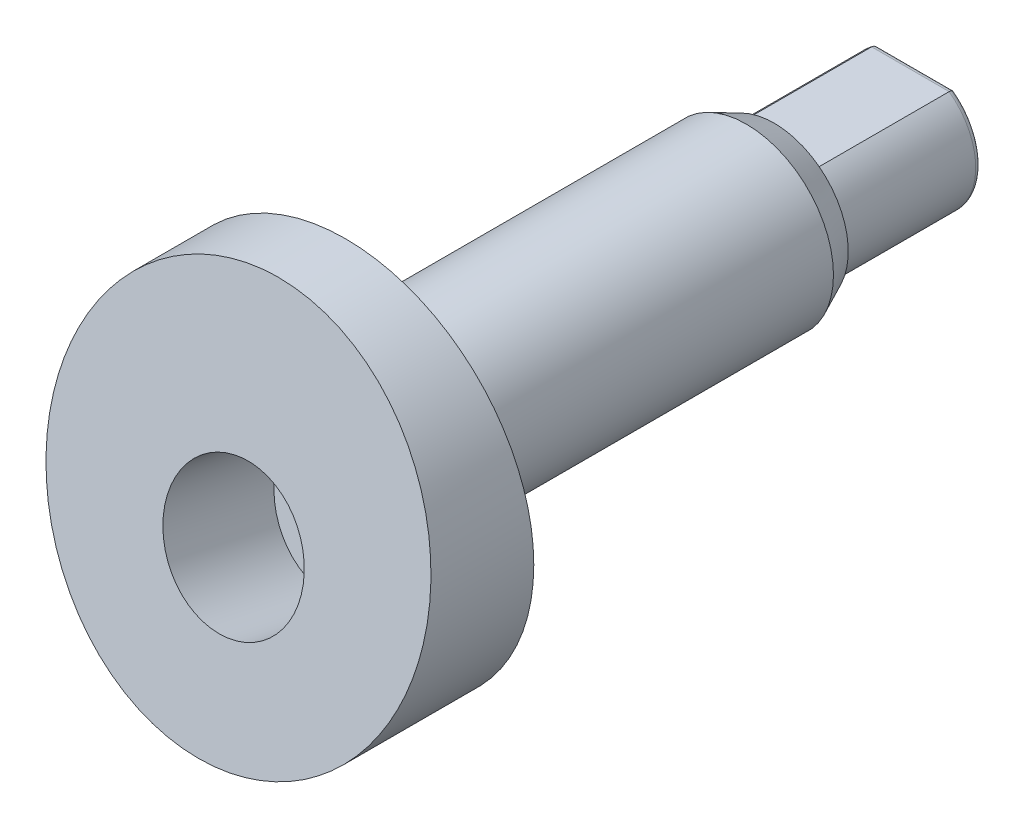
from build123d import *

# Parameters (mm, degrees)
SKETCH1_R             = 8.636
SWASH_BASE_DEPTH      = 6.7437
SWASH_ANGLE_CUT_DEPTH = 12.829383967
SKETCH4_R             = 3.99034
MOTOR_SHAFT_DEPTH     = 26.162
SKETCH5_OUTSIDE_W     = 27.468
SKETCH5_OUTSIDE_H     = 27.468
D_CUT_DEPTH           = 6.5024
FILLET4_R             = 0.254
CHAMFER1_SIZE         = 1.27
CHAMFER1_SIZE2        = 0.592210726
SKETCH9_R             = 3.175
CUT_EXTRUDE2_DEPTH    = 5.207


with BuildPart() as part:
    # Sketch1 → swash_base (new body)
    with BuildSketch(Plane.XY):
        Circle(SKETCH1_R)
    extrude(amount=SWASH_BASE_DEPTH)

    # Sketch2 → swash_angle_cut (cut, symmetric)
    with BuildSketch(Plane(origin=(0, 0, 0), x_dir=(0, 0, -1), z_dir=(1, 0, 0))):
        Polygon((-6.7437, -8.636), (-6.7437, 8.636), (-3.072423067, 8.636), align=None)
    extrude(amount=SWASH_ANGLE_CUT_DEPTH, both=True, mode=Mode.SUBTRACT)

    # Sketch4 → motor_shaft (add)
    with BuildSketch(Plane(origin=(0, 0, 0), x_dir=(-1, 0, 0), z_dir=(0, 0, -1))):
        with Locations(Location((0, 0, 0), (0, 0, 180))):
            Circle(SKETCH4_R)
    extrude(amount=MOTOR_SHAFT_DEPTH)

    # Sketch5 outside → D_cut (cut)
    with BuildSketch(Plane(origin=(0, 0, -26.162), x_dir=(-1, 0, 0), z_dir=(0, 0, -1))):
        Rectangle(SKETCH5_OUTSIDE_W, SKETCH5_OUTSIDE_H)
        with BuildLine():
            Line((0, 2.413), (1.777818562, 2.413))
            ThreePointArc((1.777818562, 2.413), (0, -2.9972), (-1.777818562, 2.413))
            Line((-1.777818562, 2.413), (0, 2.413))
        make_face(mode=Mode.SUBTRACT)
    extrude(amount=-D_CUT_DEPTH, mode=Mode.SUBTRACT)

    # Fillet4
    fillet4_edges = [part.edges().sort_by_distance(p)[0] for p in [
        (0, 2.413, -26.162),
        (0, -2.9972, -26.162),
    ]]
    fillet(fillet4_edges, radius=FILLET4_R)

    # Chamfer1
    chamfer1_edges = [part.edges().sort_by_distance(p)[0] for p in [
        (-3.99034, 0, -19.6596),
    ]]
    chamfer1_side = [part.faces().sort_by_distance(p)[0] for p in [
        (-3.99034, 0, -9.8298),
    ]]
    chamfer(chamfer1_edges, length=CHAMFER1_SIZE, length2=CHAMFER1_SIZE2, reference=chamfer1_side[0])

    # Sketch9 → Cut-Extrude2 (cut)
    with BuildSketch(Plane(origin=(0, 0.998144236, 4.695899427), x_dir=(1, 0, 0), z_dir=(0, 0.2079116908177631, 0.9781476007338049))):
        with Locations(Location((0, -2.099943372, 0), (0, 0, 270))):
            Circle(SKETCH9_R)
    extrude(amount=-CUT_EXTRUDE2_DEPTH, mode=Mode.SUBTRACT)

    # Sketch14 → Revolve2 (revolve)
    with BuildSketch(Plane(origin=(0, 0, 0), x_dir=(0, 0, -1), z_dir=(1, 0, 0)), mode=Mode.PRIVATE) as revolve2_sk:
        with BuildLine():
            Line((0, 4.24434), (0, 3.99034))
            Line((0, 3.99034), (0.254, 3.99034))
            ThreePointArc((0.254, 3.99034), (0.074394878, 4.064734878), (0, 4.24434))
        make_face()
    revolve(revolve2_sk.sketch.rotate(Axis((0, 0, -18.3896), (0, 0, 1)), 90), axis=Axis((0, 0, -18.3896), (0, 0, 1)))


solid = part.part
